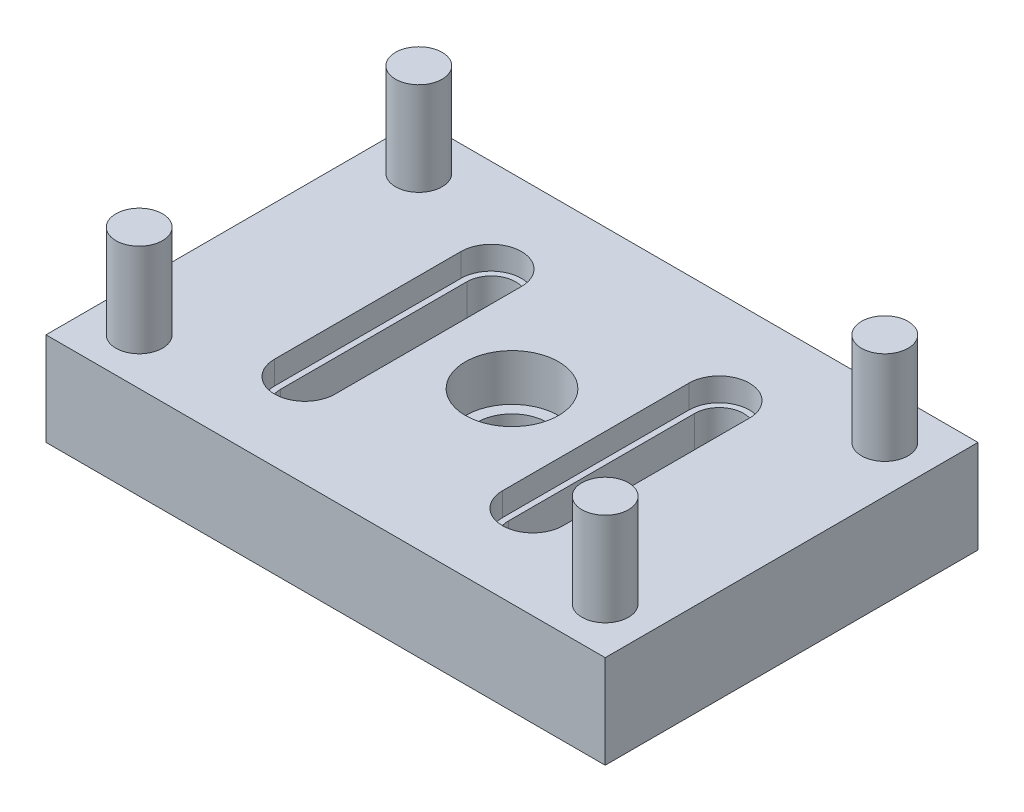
from build123d import *

# Parameters (mm, degrees)
SKETCH1_W          = 152.4
SKETCH1_H          = 101.6
EXTRUDE1_DEPTH     = 25.4
CUT_EXTRUDE1_DEPTH = 96.038097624
CUT_EXTRUDE2_DEPTH = 6.35
SKETCH1_7_R        = 6.35
EXTRUDE2_DEPTH     = 25.4
SKETCH1_8_R        = 9.525
CUT_EXTRUDE3_DEPTH = 96.038097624
SKETCH1_9_R        = 12.7
SKETCH1_9_R_2      = 9.525
CUT_EXTRUDE4_DEPTH = 12.7


with BuildPart() as part:
    # Sketch1 → Extrude1 (new body)
    with BuildSketch(Plane(origin=(0, 0, 0), x_dir=(1, 0, 0), z_dir=(0, 1, 0))):
        Rectangle(SKETCH1_W, SKETCH1_H)
    extrude(amount=-EXTRUDE1_DEPTH)

    # Sketch1_3 → Cut-Extrude1 (cut, through all)
    with BuildSketch(Plane(origin=(0, 0, 0), x_dir=(1, 0, 0), z_dir=(0, 1, 0))):
        with BuildLine():
            ThreePointArc((-24.3967, -25.4), (-31.0642, -32.0675), (-37.7317, -25.4))
            Line((-37.7317, -25.4), (-37.7317, 25.4))
            ThreePointArc((-37.7317, 25.4), (-31.0642, 32.0675), (-24.3967, 25.4))
            Line((-24.3967, 25.4), (-24.3967, -25.4))
        make_face()
        with BuildLine():
            Line((24.3967, 25.4), (24.3967, -25.4))
            ThreePointArc((24.3967, -25.4), (31.0642, -32.0675), (37.7317, -25.4))
            Line((37.7317, -25.4), (37.7317, 25.4))
            ThreePointArc((37.7317, 25.4), (31.0642, 32.0675), (24.3967, 25.4))
        make_face()
    extrude(amount=-CUT_EXTRUDE1_DEPTH, mode=Mode.SUBTRACT)

    # Sketch1_4 → Cut-Extrude2 (cut)
    # profile 1 of 2: a face of its own
    with BuildSketch(Plane(origin=(0, 0, 0), x_dir=(1, 0, 0), z_dir=(0, 1, 0))):
        with BuildLine():
            Line((22.8092, 25.4), (22.8092, -25.4))
            ThreePointArc((22.8092, -25.4), (31.0642, -33.655), (39.3192, -25.4))
            Line((39.3192, -25.4), (39.3192, 25.4))
            ThreePointArc((39.3192, 25.4), (31.0642, 33.655), (22.8092, 25.4))
        make_face()
        with BuildLine():
            ThreePointArc((24.3967, -25.4), (31.0642, -32.0675), (37.7317, -25.4))
            Line((37.7317, -25.4), (37.7317, 25.4))
            ThreePointArc((37.7317, 25.4), (31.0642, 32.0675), (24.3967, 25.4))
            Line((24.3967, 25.4), (24.3967, -25.4))
        make_face(mode=Mode.SUBTRACT)
    # profile 2 of 2: a face of its own
    with BuildSketch(Plane(origin=(0, 0, 0), x_dir=(1, 0, 0), z_dir=(0, 1, 0))):
        with BuildLine():
            ThreePointArc((-22.8092, -25.4), (-31.0642, -33.655), (-39.3192, -25.4))
            Line((-39.3192, -25.4), (-39.3192, 25.4))
            ThreePointArc((-39.3192, 25.4), (-31.0642, 33.655), (-22.8092, 25.4))
            Line((-22.8092, 25.4), (-22.8092, -25.4))
        make_face()
        with BuildLine():
            Line((-24.3967, 25.4), (-24.3967, -25.4))
            ThreePointArc((-24.3967, -25.4), (-31.0642, -32.0675), (-37.7317, -25.4))
            Line((-37.7317, -25.4), (-37.7317, 25.4))
            ThreePointArc((-37.7317, 25.4), (-31.0642, 32.0675), (-24.3967, 25.4))
        make_face(mode=Mode.SUBTRACT)
    extrude(amount=-CUT_EXTRUDE2_DEPTH, mode=Mode.SUBTRACT)

    # Sketch1_7 → Extrude2 (add)
    with BuildSketch(Plane(origin=(0, 0, 0), x_dir=(1, 0, 0), z_dir=(0, 1, 0))):
        with Locations(Location((-63.5, -38.1, 0), (0, 0, 270))):
            Circle(SKETCH1_7_R)
        with Locations(Location((-63.5, 38.1, 0), (0, 0, 270))):
            Circle(SKETCH1_7_R)
        with Locations(Location((63.5, 38.1, 0), (0, 0, 270))):
            Circle(SKETCH1_7_R)
        with Locations(Location((63.5, -38.1, 0), (0, 0, 270))):
            Circle(SKETCH1_7_R)
    extrude(amount=EXTRUDE2_DEPTH)

    # Sketch1_8 → Cut-Extrude3 (cut, through all)
    with BuildSketch(Plane(origin=(0, 0, 0), x_dir=(1, 0, 0), z_dir=(0, 1, 0))):
        with Locations(Location((0, 0, 0), (0, 0, 270))):
            Circle(SKETCH1_8_R)
    extrude(amount=-CUT_EXTRUDE3_DEPTH, mode=Mode.SUBTRACT)

    # Sketch1_9 → Cut-Extrude4 (cut)
    with BuildSketch(Plane(origin=(0, 0, 0), x_dir=(1, 0, 0), z_dir=(0, 1, 0))):
        with Locations(Location((0, 0, 0), (0, 0, 270))):
            Circle(SKETCH1_9_R)
        with Locations(Location((0, 0, 0), (0, 0, 270))):
            Circle(SKETCH1_9_R_2, mode=Mode.SUBTRACT)
    extrude(amount=-CUT_EXTRUDE4_DEPTH, mode=Mode.SUBTRACT)


solid = part.part
